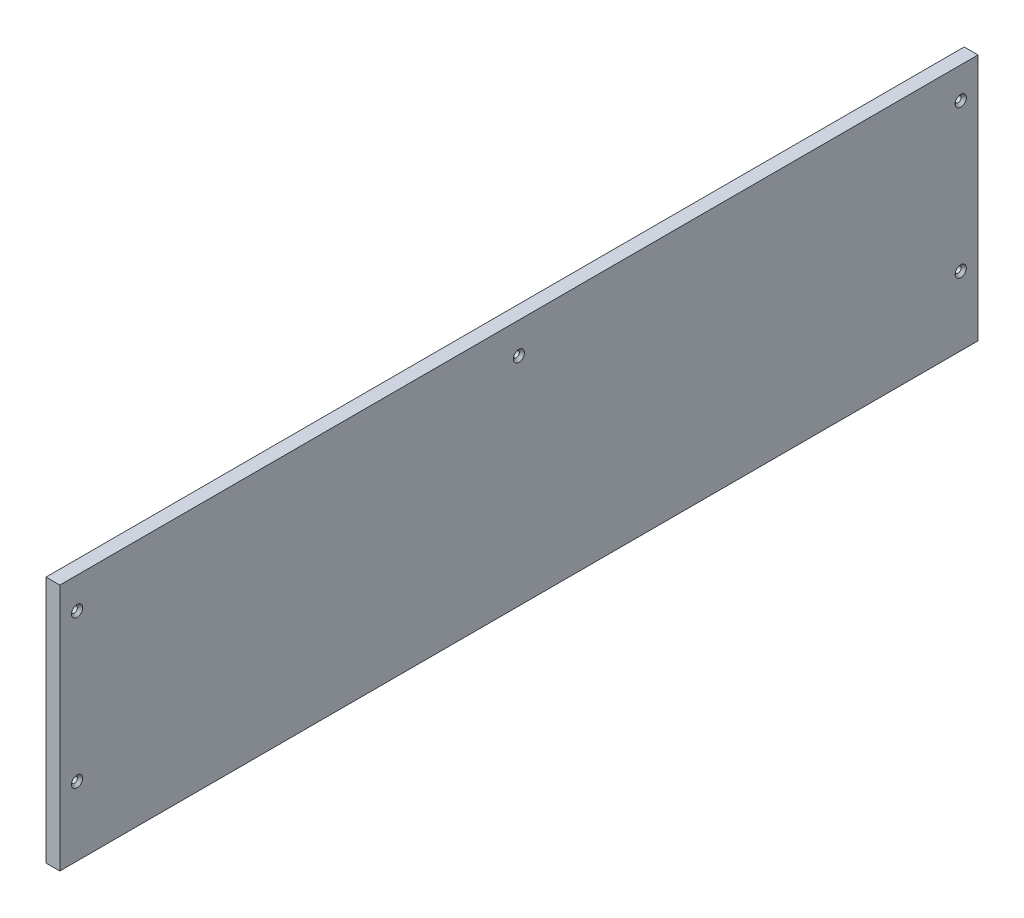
ISO-10303-21;
HEADER;
FILE_DESCRIPTION(('STEP AP214'),'2;1');
FILE_NAME('part.step','',(''),(''),'','','');
FILE_SCHEMA(('AUTOMOTIVE_DESIGN { 1 0 10303 214 1 1 1 1 }'));
ENDSEC;
DATA;
#1=APPLICATION_CONTEXT('core data for automotive mechanical design processes');
#2=APPLICATION_PROTOCOL_DEFINITION('international standard','automotive_design',2000,#1);
#3=PRODUCT_CONTEXT('',#1,'mechanical');
#4=PRODUCT('Part','Part','',(#3));
#5=PRODUCT_RELATED_PRODUCT_CATEGORY('part','',(#4));
#6=PRODUCT_DEFINITION_FORMATION('','',#4);
#7=PRODUCT_DEFINITION_CONTEXT('part definition',#1,'design');
#8=PRODUCT_DEFINITION('design','',#6,#7);
#9=PRODUCT_DEFINITION_SHAPE('','',#8);
#10=(LENGTH_UNIT() NAMED_UNIT(*) SI_UNIT(.MILLI.,.METRE.));
#11=(NAMED_UNIT(*) PLANE_ANGLE_UNIT() SI_UNIT($,.RADIAN.));
#12=(NAMED_UNIT(*) SI_UNIT($,.STERADIAN.) SOLID_ANGLE_UNIT());
#13=UNCERTAINTY_MEASURE_WITH_UNIT(LENGTH_MEASURE(1.E-05),#10,'distance_accuracy_value','');
#14=(GEOMETRIC_REPRESENTATION_CONTEXT(3) GLOBAL_UNCERTAINTY_ASSIGNED_CONTEXT((#13)) GLOBAL_UNIT_ASSIGNED_CONTEXT((#10,
#11,#12)) REPRESENTATION_CONTEXT('',''));
#15=CARTESIAN_POINT('',(0.,0.,0.));
#16=DIRECTION('',(0.,0.,1.));
#17=DIRECTION('',(1.,0.,0.));
#18=AXIS2_PLACEMENT_3D('',#15,#16,#17);
#19=CARTESIAN_POINT('',(8.,-71.75,-266.));
#20=DIRECTION('',(0.,0.,1.));
#21=DIRECTION('',(1.,0.,0.));
#22=AXIS2_PLACEMENT_3D('',#19,#20,#21);
#23=PLANE('',#22);
#24=DIRECTION('',(0.,1.,0.));
#25=VECTOR('',#24,1.);
#26=CARTESIAN_POINT('',(0.,-71.75,-266.));
#27=LINE('',#26,#25);
#28=CARTESIAN_POINT('',(0.,-71.75,-266.));
#29=VERTEX_POINT('',#28);
#30=CARTESIAN_POINT('',(0.,71.75,-266.));
#31=VERTEX_POINT('',#30);
#32=EDGE_CURVE('E115',#29,#31,#27,.T.);
#33=ORIENTED_EDGE('',*,*,#32,.T.);
#34=DIRECTION('',(-1.,0.,0.));
#35=VECTOR('',#34,1.);
#36=CARTESIAN_POINT('',(8.,71.75,-266.));
#37=LINE('',#36,#35);
#38=CARTESIAN_POINT('',(8.,71.75,-266.));
#39=VERTEX_POINT('',#38);
#40=EDGE_CURVE('E103',#39,#31,#37,.T.);
#41=ORIENTED_EDGE('',*,*,#40,.F.);
#42=DIRECTION('',(0.,1.,0.));
#43=VECTOR('',#42,1.);
#44=CARTESIAN_POINT('',(8.,-71.75,-266.));
#45=LINE('',#44,#43);
#46=CARTESIAN_POINT('',(8.,-71.75,-266.));
#47=VERTEX_POINT('',#46);
#48=EDGE_CURVE('E95',#47,#39,#45,.T.);
#49=ORIENTED_EDGE('',*,*,#48,.F.);
#50=DIRECTION('',(-1.,0.,0.));
#51=VECTOR('',#50,1.);
#52=CARTESIAN_POINT('',(8.,-71.75,-266.));
#53=LINE('',#52,#51);
#54=EDGE_CURVE('E111',#47,#29,#53,.T.);
#55=ORIENTED_EDGE('',*,*,#54,.T.);
#56=EDGE_LOOP('',(#33,#41,#49,#55));
#57=FACE_BOUND('',#56,.T.);
#58=ADVANCED_FACE('F40',(#57),#23,.F.);
#59=CARTESIAN_POINT('',(8.,71.75,266.));
#60=DIRECTION('',(0.,-1.,0.));
#61=DIRECTION('',(0.,0.,-1.));
#62=AXIS2_PLACEMENT_3D('',#59,#60,#61);
#63=PLANE('',#62);
#64=DIRECTION('',(0.,0.,1.));
#65=VECTOR('',#64,1.);
#66=CARTESIAN_POINT('',(0.,71.75,266.));
#67=LINE('',#66,#65);
#68=CARTESIAN_POINT('',(0.,71.75,266.));
#69=VERTEX_POINT('',#68);
#70=EDGE_CURVE('E101',#31,#69,#67,.T.);
#71=ORIENTED_EDGE('',*,*,#70,.T.);
#72=DIRECTION('',(-1.,0.,0.));
#73=VECTOR('',#72,1.);
#74=CARTESIAN_POINT('',(8.,71.75,266.));
#75=LINE('',#74,#73);
#76=CARTESIAN_POINT('',(8.,71.75,266.));
#77=VERTEX_POINT('',#76);
#78=EDGE_CURVE('E99',#77,#69,#75,.T.);
#79=ORIENTED_EDGE('',*,*,#78,.F.);
#80=DIRECTION('',(0.,0.,1.));
#81=VECTOR('',#80,1.);
#82=CARTESIAN_POINT('',(8.,71.75,266.));
#83=LINE('',#82,#81);
#84=EDGE_CURVE('E90',#39,#77,#83,.T.);
#85=ORIENTED_EDGE('',*,*,#84,.F.);
#86=ORIENTED_EDGE('',*,*,#40,.T.);
#87=EDGE_LOOP('',(#71,#79,#85,#86));
#88=FACE_BOUND('',#87,.T.);
#89=ADVANCED_FACE('F100',(#88),#63,.F.);
#90=CARTESIAN_POINT('',(8.,-71.75,266.));
#91=DIRECTION('',(0.,0.,-1.));
#92=DIRECTION('',(-1.,0.,0.));
#93=AXIS2_PLACEMENT_3D('',#90,#91,#92);
#94=PLANE('',#93);
#95=DIRECTION('',(0.,-1.,0.));
#96=VECTOR('',#95,1.);
#97=CARTESIAN_POINT('',(0.,-71.75,266.));
#98=LINE('',#97,#96);
#99=CARTESIAN_POINT('',(0.,-71.75,266.));
#100=VERTEX_POINT('',#99);
#101=EDGE_CURVE('E76',#69,#100,#98,.T.);
#102=ORIENTED_EDGE('',*,*,#101,.T.);
#103=DIRECTION('',(-1.,0.,0.));
#104=VECTOR('',#103,1.);
#105=CARTESIAN_POINT('',(8.,-71.75,266.));
#106=LINE('',#105,#104);
#107=CARTESIAN_POINT('',(8.,-71.75,266.));
#108=VERTEX_POINT('',#107);
#109=EDGE_CURVE('E104',#108,#100,#106,.T.);
#110=ORIENTED_EDGE('',*,*,#109,.F.);
#111=DIRECTION('',(0.,-1.,0.));
#112=VECTOR('',#111,1.);
#113=CARTESIAN_POINT('',(8.,-71.75,266.));
#114=LINE('',#113,#112);
#115=EDGE_CURVE('E93',#77,#108,#114,.T.);
#116=ORIENTED_EDGE('',*,*,#115,.F.);
#117=ORIENTED_EDGE('',*,*,#78,.T.);
#118=EDGE_LOOP('',(#102,#110,#116,#117));
#119=FACE_BOUND('',#118,.T.);
#120=ADVANCED_FACE('F106',(#119),#94,.F.);
#121=CARTESIAN_POINT('',(8.,-71.75,266.));
#122=DIRECTION('',(0.,1.,0.));
#123=DIRECTION('',(0.,0.,1.));
#124=AXIS2_PLACEMENT_3D('',#121,#122,#123);
#125=PLANE('',#124);
#126=DIRECTION('',(0.,0.,-1.));
#127=VECTOR('',#126,1.);
#128=CARTESIAN_POINT('',(0.,-71.75,266.));
#129=LINE('',#128,#127);
#130=EDGE_CURVE('E82',#100,#29,#129,.T.);
#131=ORIENTED_EDGE('',*,*,#130,.T.);
#132=ORIENTED_EDGE('',*,*,#54,.F.);
#133=DIRECTION('',(0.,0.,-1.));
#134=VECTOR('',#133,1.);
#135=CARTESIAN_POINT('',(8.,-71.75,266.));
#136=LINE('',#135,#134);
#137=EDGE_CURVE('E59',#108,#47,#136,.T.);
#138=ORIENTED_EDGE('',*,*,#137,.F.);
#139=ORIENTED_EDGE('',*,*,#109,.T.);
#140=EDGE_LOOP('',(#131,#132,#138,#139));
#141=FACE_BOUND('',#140,.T.);
#142=ADVANCED_FACE('F180',(#141),#125,.F.);
#143=CARTESIAN_POINT('',(8.,0.,0.));
#144=DIRECTION('',(-1.,0.,0.));
#145=DIRECTION('',(0.,0.,1.));
#146=AXIS2_PLACEMENT_3D('',#143,#144,#145);
#147=PLANE('',#146);
#148=CARTESIAN_POINT('',(8.,-31.75,-256.));
#149=DIRECTION('',(-1.,0.,0.));
#150=DIRECTION('',(0.,0.,1.));
#151=AXIS2_PLACEMENT_3D('',#148,#149,#150);
#152=CIRCLE('',#151,3.25000000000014);
#153=CARTESIAN_POINT('',(8.,-31.75,-252.75));
#154=VERTEX_POINT('',#153);
#155=EDGE_CURVE('E148',#154,#154,#152,.T.);
#156=ORIENTED_EDGE('',*,*,#155,.T.);
#157=EDGE_LOOP('',(#156));
#158=FACE_BOUND('',#157,.T.);
#159=CARTESIAN_POINT('',(8.,53.75,-256.));
#160=DIRECTION('',(-1.,0.,0.));
#161=DIRECTION('',(0.,0.,1.));
#162=AXIS2_PLACEMENT_3D('',#159,#160,#161);
#163=CIRCLE('',#162,3.25000000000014);
#164=CARTESIAN_POINT('',(8.,53.75,-252.75));
#165=VERTEX_POINT('',#164);
#166=EDGE_CURVE('E144',#165,#165,#163,.T.);
#167=ORIENTED_EDGE('',*,*,#166,.T.);
#168=EDGE_LOOP('',(#167));
#169=FACE_BOUND('',#168,.T.);
#170=CARTESIAN_POINT('',(8.,53.75,0.));
#171=DIRECTION('',(-1.,0.,0.));
#172=DIRECTION('',(0.,0.,1.));
#173=AXIS2_PLACEMENT_3D('',#170,#171,#172);
#174=CIRCLE('',#173,3.25000000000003);
#175=CARTESIAN_POINT('',(8.,53.75,3.25000000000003));
#176=VERTEX_POINT('',#175);
#177=EDGE_CURVE('E140',#176,#176,#174,.T.);
#178=ORIENTED_EDGE('',*,*,#177,.T.);
#179=EDGE_LOOP('',(#178));
#180=FACE_BOUND('',#179,.T.);
#181=CARTESIAN_POINT('',(8.,-31.75,256.));
#182=DIRECTION('',(-1.,0.,0.));
#183=DIRECTION('',(0.,0.,1.));
#184=AXIS2_PLACEMENT_3D('',#181,#182,#183);
#185=CIRCLE('',#184,3.25000000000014);
#186=CARTESIAN_POINT('',(8.,-31.75,259.25));
#187=VERTEX_POINT('',#186);
#188=EDGE_CURVE('E136',#187,#187,#185,.T.);
#189=ORIENTED_EDGE('',*,*,#188,.T.);
#190=EDGE_LOOP('',(#189));
#191=FACE_BOUND('',#190,.T.);
#192=CARTESIAN_POINT('',(8.,53.75,256.));
#193=DIRECTION('',(-1.,0.,0.));
#194=DIRECTION('',(0.,0.,1.));
#195=AXIS2_PLACEMENT_3D('',#192,#193,#194);
#196=CIRCLE('',#195,3.25000000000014);
#197=CARTESIAN_POINT('',(8.,53.75,259.25));
#198=VERTEX_POINT('',#197);
#199=EDGE_CURVE('E132',#198,#198,#196,.T.);
#200=ORIENTED_EDGE('',*,*,#199,.T.);
#201=EDGE_LOOP('',(#200));
#202=FACE_BOUND('',#201,.T.);
#203=ORIENTED_EDGE('',*,*,#48,.T.);
#204=ORIENTED_EDGE('',*,*,#84,.T.);
#205=ORIENTED_EDGE('',*,*,#115,.T.);
#206=ORIENTED_EDGE('',*,*,#137,.T.);
#207=EDGE_LOOP('',(#203,#204,#205,#206));
#208=FACE_BOUND('',#207,.T.);
#209=ADVANCED_FACE('F91',(#158,#169,#180,#191,#202,#208),#147,.F.);
#210=CARTESIAN_POINT('',(0.,0.,0.));
#211=DIRECTION('',(-1.,0.,0.));
#212=DIRECTION('',(0.,0.,1.));
#213=AXIS2_PLACEMENT_3D('',#210,#211,#212);
#214=PLANE('',#213);
#215=CARTESIAN_POINT('',(0.,-31.75,-256.));
#216=DIRECTION('',(-1.,0.,0.));
#217=DIRECTION('',(0.,0.,1.));
#218=AXIS2_PLACEMENT_3D('',#215,#216,#217);
#219=CIRCLE('',#218,1.75);
#220=CARTESIAN_POINT('',(0.,-31.75,-254.25));
#221=VERTEX_POINT('',#220);
#222=EDGE_CURVE('E251',#221,#221,#219,.T.);
#223=ORIENTED_EDGE('',*,*,#222,.F.);
#224=EDGE_LOOP('',(#223));
#225=FACE_BOUND('',#224,.T.);
#226=CARTESIAN_POINT('',(0.,53.75,-256.));
#227=DIRECTION('',(-1.,0.,0.));
#228=DIRECTION('',(0.,0.,1.));
#229=AXIS2_PLACEMENT_3D('',#226,#227,#228);
#230=CIRCLE('',#229,1.75);
#231=CARTESIAN_POINT('',(0.,53.75,-254.25));
#232=VERTEX_POINT('',#231);
#233=EDGE_CURVE('E243',#232,#232,#230,.T.);
#234=ORIENTED_EDGE('',*,*,#233,.F.);
#235=EDGE_LOOP('',(#234));
#236=FACE_BOUND('',#235,.T.);
#237=CARTESIAN_POINT('',(0.,53.75,0.));
#238=DIRECTION('',(-1.,0.,0.));
#239=DIRECTION('',(0.,0.,1.));
#240=AXIS2_PLACEMENT_3D('',#237,#238,#239);
#241=CIRCLE('',#240,1.75);
#242=CARTESIAN_POINT('',(0.,53.75,1.75));
#243=VERTEX_POINT('',#242);
#244=EDGE_CURVE('E239',#243,#243,#241,.T.);
#245=ORIENTED_EDGE('',*,*,#244,.F.);
#246=EDGE_LOOP('',(#245));
#247=FACE_BOUND('',#246,.T.);
#248=CARTESIAN_POINT('',(0.,53.75,256.));
#249=DIRECTION('',(-1.,0.,0.));
#250=DIRECTION('',(0.,0.,1.));
#251=AXIS2_PLACEMENT_3D('',#248,#249,#250);
#252=CIRCLE('',#251,1.75);
#253=CARTESIAN_POINT('',(0.,53.75,257.75));
#254=VERTEX_POINT('',#253);
#255=EDGE_CURVE('E242',#254,#254,#252,.T.);
#256=ORIENTED_EDGE('',*,*,#255,.F.);
#257=EDGE_LOOP('',(#256));
#258=FACE_BOUND('',#257,.T.);
#259=CARTESIAN_POINT('',(0.,-31.75,256.));
#260=DIRECTION('',(-1.,0.,0.));
#261=DIRECTION('',(0.,0.,1.));
#262=AXIS2_PLACEMENT_3D('',#259,#260,#261);
#263=CIRCLE('',#262,1.75);
#264=CARTESIAN_POINT('',(0.,-31.75,257.75));
#265=VERTEX_POINT('',#264);
#266=EDGE_CURVE('E119',#265,#265,#263,.T.);
#267=ORIENTED_EDGE('',*,*,#266,.F.);
#268=EDGE_LOOP('',(#267));
#269=FACE_BOUND('',#268,.T.);
#270=ORIENTED_EDGE('',*,*,#32,.F.);
#271=ORIENTED_EDGE('',*,*,#130,.F.);
#272=ORIENTED_EDGE('',*,*,#101,.F.);
#273=ORIENTED_EDGE('',*,*,#70,.F.);
#274=EDGE_LOOP('',(#270,#271,#272,#273));
#275=FACE_BOUND('',#274,.T.);
#276=ADVANCED_FACE('F179',(#225,#236,#247,#258,#269,#275),#214,.T.);
#277=CARTESIAN_POINT('',(0.,-31.75,256.));
#278=DIRECTION('',(-1.,0.,0.));
#279=DIRECTION('',(0.,0.,1.));
#280=AXIS2_PLACEMENT_3D('',#277,#278,#279);
#281=CYLINDRICAL_SURFACE('',#280,1.75);
#282=CARTESIAN_POINT('',(6.49999999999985,-31.75,256.));
#283=DIRECTION('',(-1.,0.,0.));
#284=DIRECTION('',(0.,0.,1.));
#285=AXIS2_PLACEMENT_3D('',#282,#283,#284);
#286=CIRCLE('',#285,1.75);
#287=CARTESIAN_POINT('',(6.49999999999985,-31.75,257.75));
#288=VERTEX_POINT('',#287);
#289=EDGE_CURVE('E51',#288,#288,#286,.F.);
#290=ORIENTED_EDGE('',*,*,#289,.T.);
#291=EDGE_LOOP('',(#290));
#292=FACE_BOUND('',#291,.T.);
#293=ORIENTED_EDGE('',*,*,#266,.T.);
#294=EDGE_LOOP('',(#293));
#295=FACE_BOUND('',#294,.T.);
#296=ADVANCED_FACE('F168',(#292,#295),#281,.F.);
#297=CARTESIAN_POINT('',(0.,53.75,256.));
#298=DIRECTION('',(-1.,0.,0.));
#299=DIRECTION('',(0.,0.,1.));
#300=AXIS2_PLACEMENT_3D('',#297,#298,#299);
#301=CYLINDRICAL_SURFACE('',#300,1.75);
#302=CARTESIAN_POINT('',(6.49999999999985,53.75,256.));
#303=DIRECTION('',(-1.,0.,0.));
#304=DIRECTION('',(0.,0.,1.));
#305=AXIS2_PLACEMENT_3D('',#302,#303,#304);
#306=CIRCLE('',#305,1.75);
#307=CARTESIAN_POINT('',(6.49999999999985,53.75,257.75));
#308=VERTEX_POINT('',#307);
#309=EDGE_CURVE('E11',#308,#308,#306,.F.);
#310=ORIENTED_EDGE('',*,*,#309,.T.);
#311=EDGE_LOOP('',(#310));
#312=FACE_BOUND('',#311,.T.);
#313=ORIENTED_EDGE('',*,*,#255,.T.);
#314=EDGE_LOOP('',(#313));
#315=FACE_BOUND('',#314,.T.);
#316=ADVANCED_FACE('F235',(#312,#315),#301,.F.);
#317=CARTESIAN_POINT('',(0.,53.75,0.));
#318=DIRECTION('',(-1.,0.,0.));
#319=DIRECTION('',(0.,0.,1.));
#320=AXIS2_PLACEMENT_3D('',#317,#318,#319);
#321=CYLINDRICAL_SURFACE('',#320,1.75);
#322=CARTESIAN_POINT('',(6.49999999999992,53.75,0.));
#323=DIRECTION('',(-1.,0.,0.));
#324=DIRECTION('',(0.,0.,1.));
#325=AXIS2_PLACEMENT_3D('',#322,#323,#324);
#326=CIRCLE('',#325,1.75);
#327=CARTESIAN_POINT('',(6.49999999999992,53.75,1.75));
#328=VERTEX_POINT('',#327);
#329=EDGE_CURVE('E160',#328,#328,#326,.F.);
#330=ORIENTED_EDGE('',*,*,#329,.T.);
#331=EDGE_LOOP('',(#330));
#332=FACE_BOUND('',#331,.T.);
#333=ORIENTED_EDGE('',*,*,#244,.T.);
#334=EDGE_LOOP('',(#333));
#335=FACE_BOUND('',#334,.T.);
#336=ADVANCED_FACE('F231',(#332,#335),#321,.F.);
#337=CARTESIAN_POINT('',(0.,53.75,-256.));
#338=DIRECTION('',(-1.,0.,0.));
#339=DIRECTION('',(0.,0.,1.));
#340=AXIS2_PLACEMENT_3D('',#337,#338,#339);
#341=CYLINDRICAL_SURFACE('',#340,1.75);
#342=CARTESIAN_POINT('',(6.49999999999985,53.75,-256.));
#343=DIRECTION('',(-1.,0.,0.));
#344=DIRECTION('',(0.,0.,1.));
#345=AXIS2_PLACEMENT_3D('',#342,#343,#344);
#346=CIRCLE('',#345,1.75);
#347=CARTESIAN_POINT('',(6.49999999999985,53.75,-254.25));
#348=VERTEX_POINT('',#347);
#349=EDGE_CURVE('E156',#348,#348,#346,.F.);
#350=ORIENTED_EDGE('',*,*,#349,.T.);
#351=EDGE_LOOP('',(#350));
#352=FACE_BOUND('',#351,.T.);
#353=ORIENTED_EDGE('',*,*,#233,.T.);
#354=EDGE_LOOP('',(#353));
#355=FACE_BOUND('',#354,.T.);
#356=ADVANCED_FACE('F234',(#352,#355),#341,.F.);
#357=CARTESIAN_POINT('',(0.,-31.75,-256.));
#358=DIRECTION('',(-1.,0.,0.));
#359=DIRECTION('',(0.,0.,1.));
#360=AXIS2_PLACEMENT_3D('',#357,#358,#359);
#361=CYLINDRICAL_SURFACE('',#360,1.75);
#362=CARTESIAN_POINT('',(6.49999999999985,-31.75,-256.));
#363=DIRECTION('',(-1.,0.,0.));
#364=DIRECTION('',(0.,0.,1.));
#365=AXIS2_PLACEMENT_3D('',#362,#363,#364);
#366=CIRCLE('',#365,1.75);
#367=CARTESIAN_POINT('',(6.49999999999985,-31.75,-254.25));
#368=VERTEX_POINT('',#367);
#369=EDGE_CURVE('E152',#368,#368,#366,.F.);
#370=ORIENTED_EDGE('',*,*,#369,.T.);
#371=EDGE_LOOP('',(#370));
#372=FACE_BOUND('',#371,.T.);
#373=ORIENTED_EDGE('',*,*,#222,.T.);
#374=EDGE_LOOP('',(#373));
#375=FACE_BOUND('',#374,.T.);
#376=ADVANCED_FACE('F207',(#372,#375),#361,.F.);
#377=CARTESIAN_POINT('',(8.,-31.75,-256.));
#378=DIRECTION('',(1.,0.,0.));
#379=DIRECTION('',(0.,0.,-1.));
#380=AXIS2_PLACEMENT_3D('',#377,#378,#379);
#381=CONICAL_SURFACE('',#380,3.25000000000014,0.785398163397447);
#382=ORIENTED_EDGE('',*,*,#369,.F.);
#383=EDGE_LOOP('',(#382));
#384=FACE_BOUND('',#383,.T.);
#385=ORIENTED_EDGE('',*,*,#155,.F.);
#386=EDGE_LOOP('',(#385));
#387=FACE_BOUND('',#386,.T.);
#388=ADVANCED_FACE('F200',(#384,#387),#381,.F.);
#389=CARTESIAN_POINT('',(8.,53.75,-256.));
#390=DIRECTION('',(1.,0.,0.));
#391=DIRECTION('',(0.,0.,-1.));
#392=AXIS2_PLACEMENT_3D('',#389,#390,#391);
#393=CONICAL_SURFACE('',#392,3.25000000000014,0.785398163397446);
#394=ORIENTED_EDGE('',*,*,#349,.F.);
#395=EDGE_LOOP('',(#394));
#396=FACE_BOUND('',#395,.T.);
#397=ORIENTED_EDGE('',*,*,#166,.F.);
#398=EDGE_LOOP('',(#397));
#399=FACE_BOUND('',#398,.T.);
#400=ADVANCED_FACE('F206',(#396,#399),#393,.F.);
#401=CARTESIAN_POINT('',(8.,53.75,0.));
#402=DIRECTION('',(1.,0.,0.));
#403=DIRECTION('',(0.,0.,-1.));
#404=AXIS2_PLACEMENT_3D('',#401,#402,#403);
#405=CONICAL_SURFACE('',#404,3.25000000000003,0.785398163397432);
#406=ORIENTED_EDGE('',*,*,#329,.F.);
#407=EDGE_LOOP('',(#406));
#408=FACE_BOUND('',#407,.T.);
#409=ORIENTED_EDGE('',*,*,#177,.F.);
#410=EDGE_LOOP('',(#409));
#411=FACE_BOUND('',#410,.T.);
#412=ADVANCED_FACE('F174',(#408,#411),#405,.F.);
#413=CARTESIAN_POINT('',(8.,-31.75,256.));
#414=DIRECTION('',(1.,0.,0.));
#415=DIRECTION('',(0.,0.,-1.));
#416=AXIS2_PLACEMENT_3D('',#413,#414,#415);
#417=CONICAL_SURFACE('',#416,3.25000000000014,0.785398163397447);
#418=ORIENTED_EDGE('',*,*,#289,.F.);
#419=EDGE_LOOP('',(#418));
#420=FACE_BOUND('',#419,.T.);
#421=ORIENTED_EDGE('',*,*,#188,.F.);
#422=EDGE_LOOP('',(#421));
#423=FACE_BOUND('',#422,.T.);
#424=ADVANCED_FACE('F171',(#420,#423),#417,.F.);
#425=CARTESIAN_POINT('',(8.,53.75,256.));
#426=DIRECTION('',(1.,0.,0.));
#427=DIRECTION('',(0.,0.,-1.));
#428=AXIS2_PLACEMENT_3D('',#425,#426,#427);
#429=CONICAL_SURFACE('',#428,3.25000000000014,0.785398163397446);
#430=ORIENTED_EDGE('',*,*,#309,.F.);
#431=EDGE_LOOP('',(#430));
#432=FACE_BOUND('',#431,.T.);
#433=ORIENTED_EDGE('',*,*,#199,.F.);
#434=EDGE_LOOP('',(#433));
#435=FACE_BOUND('',#434,.T.);
#436=ADVANCED_FACE('F43',(#432,#435),#429,.F.);
#437=CLOSED_SHELL('',(#58,#89,#120,#142,#209,#276,#296,#316,#336,#356,#376,#388,#400,#412,#424,#436));
#438=MANIFOLD_SOLID_BREP('B2',#437);
#439=ADVANCED_BREP_SHAPE_REPRESENTATION('',(#18,#438),#14);
#440=SHAPE_DEFINITION_REPRESENTATION(#9,#439);
ENDSEC;
END-ISO-10303-21;
